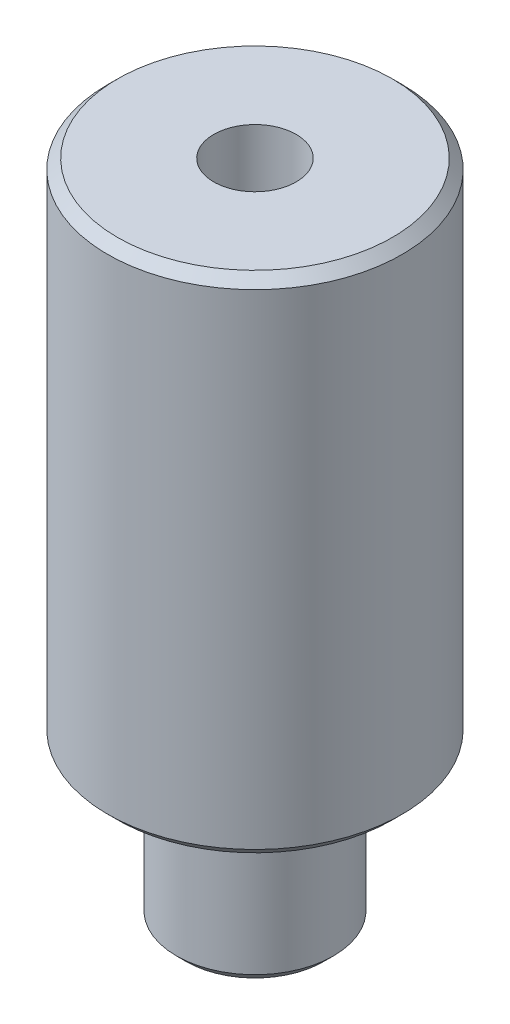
ISO-10303-21;
HEADER;
FILE_DESCRIPTION(('STEP AP214'),'2;1');
FILE_NAME('part.step','',(''),(''),'','','');
FILE_SCHEMA(('AUTOMOTIVE_DESIGN { 1 0 10303 214 1 1 1 1 }'));
ENDSEC;
DATA;
#1=APPLICATION_CONTEXT('core data for automotive mechanical design processes');
#2=APPLICATION_PROTOCOL_DEFINITION('international standard','automotive_design',2000,#1);
#3=PRODUCT_CONTEXT('',#1,'mechanical');
#4=PRODUCT('Part','Part','',(#3));
#5=PRODUCT_RELATED_PRODUCT_CATEGORY('part','',(#4));
#6=PRODUCT_DEFINITION_FORMATION('','',#4);
#7=PRODUCT_DEFINITION_CONTEXT('part definition',#1,'design');
#8=PRODUCT_DEFINITION('design','',#6,#7);
#9=PRODUCT_DEFINITION_SHAPE('','',#8);
#10=(LENGTH_UNIT() NAMED_UNIT(*) SI_UNIT(.MILLI.,.METRE.));
#11=(NAMED_UNIT(*) PLANE_ANGLE_UNIT() SI_UNIT($,.RADIAN.));
#12=(NAMED_UNIT(*) SI_UNIT($,.STERADIAN.) SOLID_ANGLE_UNIT());
#13=UNCERTAINTY_MEASURE_WITH_UNIT(LENGTH_MEASURE(1.E-05),#10,'distance_accuracy_value','');
#14=(GEOMETRIC_REPRESENTATION_CONTEXT(3) GLOBAL_UNCERTAINTY_ASSIGNED_CONTEXT((#13)) GLOBAL_UNIT_ASSIGNED_CONTEXT((#10,
#11,#12)) REPRESENTATION_CONTEXT('',''));
#15=CARTESIAN_POINT('',(0.,0.,0.));
#16=DIRECTION('',(0.,0.,1.));
#17=DIRECTION('',(1.,0.,0.));
#18=AXIS2_PLACEMENT_3D('',#15,#16,#17);
#19=CARTESIAN_POINT('',(0.,-8.00000000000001,0.));
#20=DIRECTION('',(0.,-1.,0.));
#21=DIRECTION('',(1.,0.,0.));
#22=AXIS2_PLACEMENT_3D('',#19,#20,#21);
#23=PLANE('',#22);
#24=CARTESIAN_POINT('',(0.,-8.0000000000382,0.));
#25=DIRECTION('',(0.,1.,0.));
#26=DIRECTION('',(0.,0.,1.));
#27=AXIS2_PLACEMENT_3D('',#24,#25,#26);
#28=CIRCLE('',#27,3.49999999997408);
#29=CARTESIAN_POINT('',(0.,-8.0000000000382,3.49999999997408));
#30=VERTEX_POINT('',#29);
#31=EDGE_CURVE('E19',#30,#30,#28,.T.);
#32=ORIENTED_EDGE('',*,*,#31,.F.);
#33=EDGE_LOOP('',(#32));
#34=FACE_BOUND('',#33,.T.);
#35=ADVANCED_FACE('F16',(#34),#23,.T.);
#36=CARTESIAN_POINT('',(0.,-7.49999999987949,0.));
#37=DIRECTION('',(0.,1.,0.));
#38=DIRECTION('',(0.,0.,1.));
#39=AXIS2_PLACEMENT_3D('',#36,#37,#38);
#40=CONICAL_SURFACE('',#39,4.00000000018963,0.785398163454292);
#41=CARTESIAN_POINT('',(0.,-7.50000000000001,0.));
#42=DIRECTION('',(0.,-1.,0.));
#43=DIRECTION('',(1.,0.,0.));
#44=AXIS2_PLACEMENT_3D('',#41,#42,#43);
#45=CIRCLE('',#44,4.);
#46=CARTESIAN_POINT('',(4.,-7.50000000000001,0.));
#47=VERTEX_POINT('',#46);
#48=EDGE_CURVE('E38',#47,#47,#45,.F.);
#49=ORIENTED_EDGE('',*,*,#48,.F.);
#50=EDGE_LOOP('',(#49));
#51=FACE_BOUND('',#50,.T.);
#52=ORIENTED_EDGE('',*,*,#31,.T.);
#53=EDGE_LOOP('',(#52));
#54=FACE_BOUND('',#53,.T.);
#55=ADVANCED_FACE('F31',(#51,#54),#40,.T.);
#56=CARTESIAN_POINT('',(0.,15.700000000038,0.));
#57=DIRECTION('',(0.,1.,0.));
#58=DIRECTION('',(0.,0.,1.));
#59=AXIS2_PLACEMENT_3D('',#56,#57,#58);
#60=CONICAL_SURFACE('',#59,2.09999999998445,1.02974425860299);
#61=CARTESIAN_POINT('',(0.,14.4381926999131,0.));
#62=VERTEX_POINT('',#61);
#63=VERTEX_LOOP('',#62);
#64=FACE_BOUND('',#63,.T.);
#65=CARTESIAN_POINT('',(0.,15.7,0.));
#66=DIRECTION('',(0.,1.,0.));
#67=DIRECTION('',(-1.,0.,0.));
#68=AXIS2_PLACEMENT_3D('',#65,#66,#67);
#69=CIRCLE('',#68,2.1);
#70=CARTESIAN_POINT('',(-2.1,15.7,0.));
#71=VERTEX_POINT('',#70);
#72=EDGE_CURVE('E35',#71,#71,#69,.T.);
#73=ORIENTED_EDGE('',*,*,#72,.T.);
#74=EDGE_LOOP('',(#73));
#75=FACE_BOUND('',#74,.T.);
#76=ADVANCED_FACE('F27',(#64,#75),#60,.F.);
#77=CARTESIAN_POINT('',(0.,0.,0.));
#78=DIRECTION('',(0.,-1.,0.));
#79=DIRECTION('',(1.,0.,0.));
#80=AXIS2_PLACEMENT_3D('',#77,#78,#79);
#81=CYLINDRICAL_SURFACE('',#80,4.);
#82=ORIENTED_EDGE('',*,*,#48,.T.);
#83=EDGE_LOOP('',(#82));
#84=FACE_BOUND('',#83,.T.);
#85=CARTESIAN_POINT('',(0.,0.,0.));
#86=DIRECTION('',(0.,-1.,0.));
#87=DIRECTION('',(1.,0.,0.));
#88=AXIS2_PLACEMENT_3D('',#85,#86,#87);
#89=CIRCLE('',#88,4.);
#90=CARTESIAN_POINT('',(4.,0.,0.));
#91=VERTEX_POINT('',#90);
#92=EDGE_CURVE('E37',#91,#91,#89,.T.);
#93=ORIENTED_EDGE('',*,*,#92,.T.);
#94=EDGE_LOOP('',(#93));
#95=FACE_BOUND('',#94,.T.);
#96=ADVANCED_FACE('F30',(#84,#95),#81,.T.);
#97=CARTESIAN_POINT('',(0.,13.87510233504,0.));
#98=DIRECTION('',(0.,1.,0.));
#99=DIRECTION('',(-1.,0.,0.));
#100=AXIS2_PLACEMENT_3D('',#97,#98,#99);
#101=CYLINDRICAL_SURFACE('',#100,2.1);
#102=ORIENTED_EDGE('',*,*,#72,.F.);
#103=EDGE_LOOP('',(#102));
#104=FACE_BOUND('',#103,.T.);
#105=CARTESIAN_POINT('',(0.,25.7,0.));
#106=DIRECTION('',(0.,1.,0.));
#107=DIRECTION('',(-1.,0.,0.));
#108=AXIS2_PLACEMENT_3D('',#105,#106,#107);
#109=CIRCLE('',#108,2.1);
#110=CARTESIAN_POINT('',(-2.1,25.7,0.));
#111=VERTEX_POINT('',#110);
#112=EDGE_CURVE('E41',#111,#111,#109,.F.);
#113=ORIENTED_EDGE('',*,*,#112,.F.);
#114=EDGE_LOOP('',(#113));
#115=FACE_BOUND('',#114,.T.);
#116=ADVANCED_FACE('F57',(#104,#115),#101,.F.);
#117=CARTESIAN_POINT('',(0.,0.,0.));
#118=DIRECTION('',(0.,1.,0.));
#119=DIRECTION('',(-1.,0.,0.));
#120=AXIS2_PLACEMENT_3D('',#117,#118,#119);
#121=PLANE('',#120);
#122=CARTESIAN_POINT('',(0.,0.,0.));
#123=DIRECTION('',(0.,1.,0.));
#124=DIRECTION('',(-1.,0.,0.));
#125=AXIS2_PLACEMENT_3D('',#122,#123,#124);
#126=CIRCLE('',#125,7.00000000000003);
#127=CARTESIAN_POINT('',(-7.00000000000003,0.,0.));
#128=VERTEX_POINT('',#127);
#129=EDGE_CURVE('E49',#128,#128,#126,.T.);
#130=ORIENTED_EDGE('',*,*,#129,.F.);
#131=EDGE_LOOP('',(#130));
#132=FACE_BOUND('',#131,.T.);
#133=ORIENTED_EDGE('',*,*,#92,.F.);
#134=EDGE_LOOP('',(#133));
#135=FACE_BOUND('',#134,.T.);
#136=ADVANCED_FACE('F59',(#132,#135),#121,.F.);
#137=CARTESIAN_POINT('',(0.,25.7,0.));
#138=DIRECTION('',(0.,1.,0.));
#139=DIRECTION('',(-1.,0.,0.));
#140=AXIS2_PLACEMENT_3D('',#137,#138,#139);
#141=PLANE('',#140);
#142=CARTESIAN_POINT('',(0.,25.7000000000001,0.));
#143=DIRECTION('',(0.,-1.,0.));
#144=DIRECTION('',(0.,0.,-1.));
#145=AXIS2_PLACEMENT_3D('',#142,#143,#144);
#146=CIRCLE('',#145,7.00000000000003);
#147=CARTESIAN_POINT('',(0.,25.7000000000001,-7.00000000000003));
#148=VERTEX_POINT('',#147);
#149=EDGE_CURVE('E46',#148,#148,#146,.T.);
#150=ORIENTED_EDGE('',*,*,#149,.F.);
#151=EDGE_LOOP('',(#150));
#152=FACE_BOUND('',#151,.T.);
#153=ORIENTED_EDGE('',*,*,#112,.T.);
#154=EDGE_LOOP('',(#153));
#155=FACE_BOUND('',#154,.T.);
#156=ADVANCED_FACE('F55',(#152,#155),#141,.T.);
#157=CARTESIAN_POINT('',(0.,0.499999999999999,0.));
#158=DIRECTION('',(0.,1.,0.));
#159=DIRECTION('',(-1.,0.,0.));
#160=AXIS2_PLACEMENT_3D('',#157,#158,#159);
#161=CONICAL_SURFACE('',#160,7.49999999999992,0.7853981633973);
#162=CARTESIAN_POINT('',(0.,0.5,0.));
#163=DIRECTION('',(0.,1.,0.));
#164=DIRECTION('',(-1.,0.,0.));
#165=AXIS2_PLACEMENT_3D('',#162,#163,#164);
#166=CIRCLE('',#165,7.5);
#167=CARTESIAN_POINT('',(-7.5,0.5,0.));
#168=VERTEX_POINT('',#167);
#169=EDGE_CURVE('E23',#168,#168,#166,.T.);
#170=ORIENTED_EDGE('',*,*,#169,.F.);
#171=EDGE_LOOP('',(#170));
#172=FACE_BOUND('',#171,.T.);
#173=ORIENTED_EDGE('',*,*,#129,.T.);
#174=EDGE_LOOP('',(#173));
#175=FACE_BOUND('',#174,.T.);
#176=ADVANCED_FACE('F78',(#172,#175),#161,.T.);
#177=CARTESIAN_POINT('',(0.,25.2,0.));
#178=DIRECTION('',(0.,-1.,0.));
#179=DIRECTION('',(0.,0.,-1.));
#180=AXIS2_PLACEMENT_3D('',#177,#178,#179);
#181=CONICAL_SURFACE('',#180,7.49999999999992,0.785398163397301);
#182=CARTESIAN_POINT('',(0.,25.2,0.));
#183=DIRECTION('',(0.,1.,0.));
#184=DIRECTION('',(-1.,0.,0.));
#185=AXIS2_PLACEMENT_3D('',#182,#183,#184);
#186=CIRCLE('',#185,7.5);
#187=CARTESIAN_POINT('',(-7.5,25.2,0.));
#188=VERTEX_POINT('',#187);
#189=EDGE_CURVE('E11',#188,#188,#186,.F.);
#190=ORIENTED_EDGE('',*,*,#189,.F.);
#191=EDGE_LOOP('',(#190));
#192=FACE_BOUND('',#191,.T.);
#193=ORIENTED_EDGE('',*,*,#149,.T.);
#194=EDGE_LOOP('',(#193));
#195=FACE_BOUND('',#194,.T.);
#196=ADVANCED_FACE('F72',(#192,#195),#181,.T.);
#197=CARTESIAN_POINT('',(0.,0.,0.));
#198=DIRECTION('',(0.,1.,0.));
#199=DIRECTION('',(-1.,0.,0.));
#200=AXIS2_PLACEMENT_3D('',#197,#198,#199);
#201=CYLINDRICAL_SURFACE('',#200,7.5);
#202=ORIENTED_EDGE('',*,*,#189,.T.);
#203=EDGE_LOOP('',(#202));
#204=FACE_BOUND('',#203,.T.);
#205=ORIENTED_EDGE('',*,*,#169,.T.);
#206=EDGE_LOOP('',(#205));
#207=FACE_BOUND('',#206,.T.);
#208=ADVANCED_FACE('F70',(#204,#207),#201,.T.);
#209=CLOSED_SHELL('',(#35,#55,#76,#96,#116,#136,#156,#176,#196,#208));
#210=MANIFOLD_SOLID_BREP('B1',#209);
#211=ADVANCED_BREP_SHAPE_REPRESENTATION('',(#18,#210),#14);
#212=SHAPE_DEFINITION_REPRESENTATION(#9,#211);
ENDSEC;
END-ISO-10303-21;
